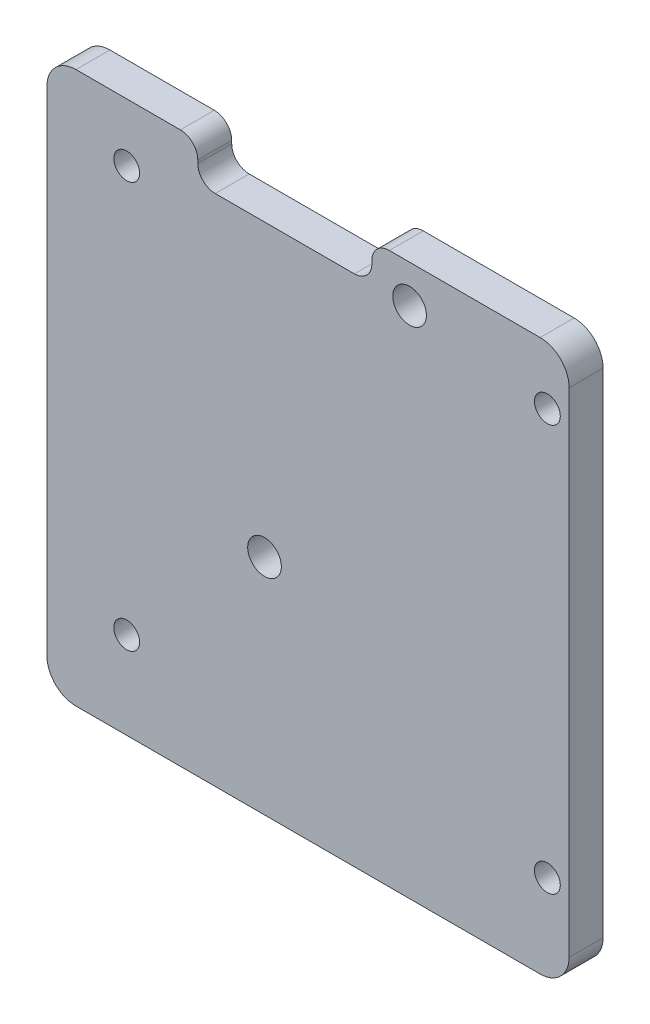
from build123d import *

# Parameters (mm, degrees)
SKETCH1_W             = 45.72
SKETCH1_H             = 48.26
BOSS_EXTRUDE1_DEPTH   = 2.9718
F_4_CLEARANCE_HOLE1_D = 2.9464
SKETCH6_W             = 15.24
SKETCH6_H             = 6.604
CUT_EXTRUDE1_DEPTH    = 34.371666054
FILLET1_R             = 1.524
F_2_CLEARANCE_HOLE1_D = 2.2606
FILLET2_R             = 2.54


with BuildPart() as part:
    # Sketch1 → Boss-Extrude1 (new body)
    with BuildSketch(Plane.XY):
        Rectangle(SKETCH1_W, SKETCH1_H)
    extrude(amount=BOSS_EXTRUDE1_DEPTH)

    # 4 Clearance Hole1 (through all)
    with Locations(Plane.XY.offset(2.9718)):
        with Locations((-3.81, -4.572), (8.89, 20.828)):
            Hole(F_4_CLEARANCE_HOLE1_D / 2)

    # Sketch6 → Cut-Extrude1 (cut, through all)
    with BuildSketch(Plane.XY.offset(2.9718)):
        with Locations((-2.032, 24.13)):
            Rectangle(SKETCH6_W, SKETCH6_H)
    extrude(amount=-CUT_EXTRUDE1_DEPTH, mode=Mode.SUBTRACT)

    # Fillet1
    fillet1_edges = [part.edges().sort_by_distance(p)[0] for p in [
        (-9.652, 24.13, 1.4859),
        (-9.652, 20.828, 1.4859),
        (5.588, 24.13, 1.4859),
        (5.588, 20.828, 1.4859),
    ]]
    fillet(fillet1_edges, radius=FILLET1_R)

    # 2 Clearance Hole1 (through all)
    with Locations(Plane.XY.offset(2.9718)):
        with Locations((20.955, -16.51), (-15.875, 19.05), (20.955, 19.05), (-15.875, -16.51)):
            Hole(F_2_CLEARANCE_HOLE1_D / 2)

    # Fillet2
    fillet2_edges = [part.edges().sort_by_distance(p)[0] for p in [
        (22.86, -24.13, 1.4859),
        (-22.86, -24.13, 1.4859),
        (-22.86, 24.13, 1.4859),
        (22.86, 24.13, 1.4859),
    ]]
    fillet(fillet2_edges, radius=FILLET2_R)


solid = part.part
